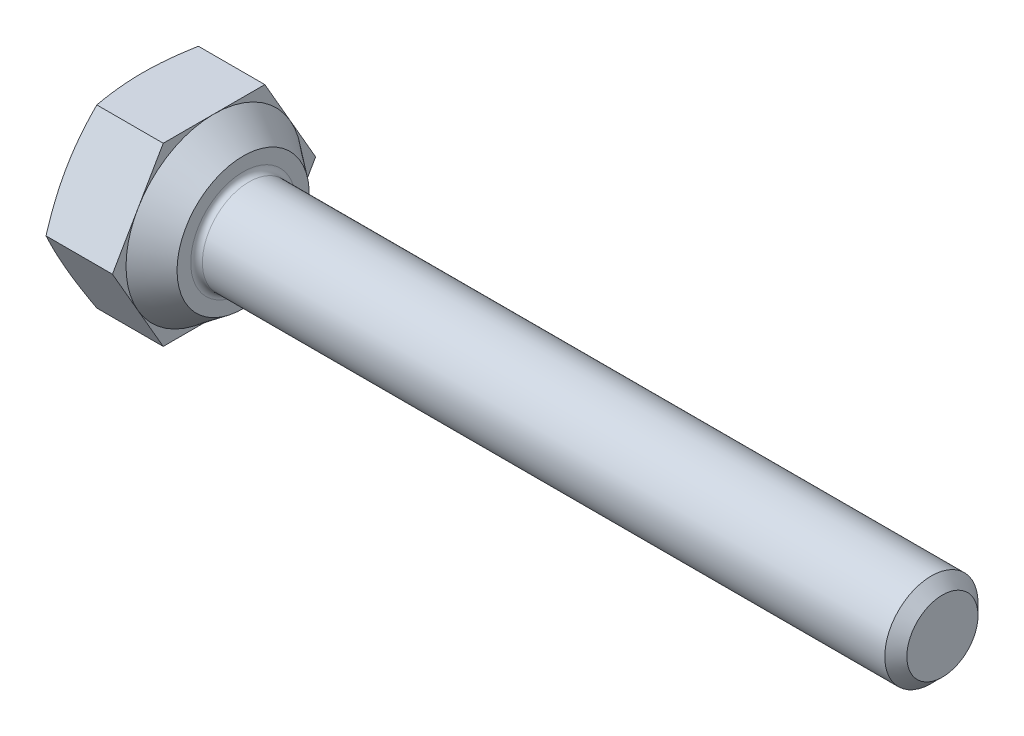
ISO-10303-21;
HEADER;
FILE_DESCRIPTION(('STEP AP214'),'2;1');
FILE_NAME('part.step','',(''),(''),'','','');
FILE_SCHEMA(('AUTOMOTIVE_DESIGN { 1 0 10303 214 1 1 1 1 }'));
ENDSEC;
DATA;
#1=APPLICATION_CONTEXT('core data for automotive mechanical design processes');
#2=APPLICATION_PROTOCOL_DEFINITION('international standard','automotive_design',2000,#1);
#3=PRODUCT_CONTEXT('',#1,'mechanical');
#4=PRODUCT('Part','Part','',(#3));
#5=PRODUCT_RELATED_PRODUCT_CATEGORY('part','',(#4));
#6=PRODUCT_DEFINITION_FORMATION('','',#4);
#7=PRODUCT_DEFINITION_CONTEXT('part definition',#1,'design');
#8=PRODUCT_DEFINITION('design','',#6,#7);
#9=PRODUCT_DEFINITION_SHAPE('','',#8);
#10=(LENGTH_UNIT() NAMED_UNIT(*) SI_UNIT(.MILLI.,.METRE.));
#11=(NAMED_UNIT(*) PLANE_ANGLE_UNIT() SI_UNIT($,.RADIAN.));
#12=(NAMED_UNIT(*) SI_UNIT($,.STERADIAN.) SOLID_ANGLE_UNIT());
#13=UNCERTAINTY_MEASURE_WITH_UNIT(LENGTH_MEASURE(1.E-05),#10,'distance_accuracy_value','');
#14=(GEOMETRIC_REPRESENTATION_CONTEXT(3) GLOBAL_UNCERTAINTY_ASSIGNED_CONTEXT((#13)) GLOBAL_UNIT_ASSIGNED_CONTEXT((#10,
#11,#12)) REPRESENTATION_CONTEXT('',''));
#15=CARTESIAN_POINT('',(0.,0.,0.));
#16=DIRECTION('',(0.,0.,1.));
#17=DIRECTION('',(1.,0.,0.));
#18=AXIS2_PLACEMENT_3D('',#15,#16,#17);
#19=CARTESIAN_POINT('',(1.725,0.,0.));
#20=DIRECTION('',(1.,0.,0.));
#21=DIRECTION('',(0.,0.,-1.));
#22=AXIS2_PLACEMENT_3D('',#19,#20,#21);
#23=PLANE('',#22);
#24=CARTESIAN_POINT('',(1.725,0.,0.));
#25=DIRECTION('',(1.,0.,0.));
#26=DIRECTION('',(0.,0.,-1.));
#27=AXIS2_PLACEMENT_3D('',#24,#25,#26);
#28=CIRCLE('',#27,0.9);
#29=CARTESIAN_POINT('',(1.725,0.,-0.9));
#30=VERTEX_POINT('',#29);
#31=EDGE_CURVE('E189',#30,#30,#28,.F.);
#32=ORIENTED_EDGE('',*,*,#31,.T.);
#33=EDGE_LOOP('',(#32));
#34=FACE_BOUND('',#33,.T.);
#35=CARTESIAN_POINT('',(1.725,0.,0.));
#36=DIRECTION('',(-1.,0.,0.));
#37=DIRECTION('',(0.,0.,1.));
#38=AXIS2_PLACEMENT_3D('',#35,#36,#37);
#39=CIRCLE('',#38,1.135);
#40=CARTESIAN_POINT('',(1.725,0.,1.135));
#41=VERTEX_POINT('',#40);
#42=EDGE_CURVE('E140',#41,#41,#39,.T.);
#43=ORIENTED_EDGE('',*,*,#42,.F.);
#44=EDGE_LOOP('',(#43));
#45=FACE_BOUND('',#44,.T.);
#46=ADVANCED_FACE('F34',(#34,#45),#23,.T.);
#47=CARTESIAN_POINT('',(1.225,0.,-1.74359781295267));
#48=DIRECTION('',(1.,0.,0.));
#49=DIRECTION('',(0.,0.,-1.));
#50=AXIS2_PLACEMENT_3D('',#47,#48,#49);
#51=PLANE('',#50);
#52=DIRECTION('',(0.,-0.866025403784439,0.5));
#53=VECTOR('',#52,1.);
#54=CARTESIAN_POINT('',(1.225,1.51,0.871798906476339));
#55=LINE('',#54,#53);
#56=CARTESIAN_POINT('',(1.225,1.51,0.871798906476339));
#57=VERTEX_POINT('',#56);
#58=CARTESIAN_POINT('',(1.225,0.755000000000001,1.30769835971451));
#59=VERTEX_POINT('',#58);
#60=EDGE_CURVE('E139',#57,#59,#55,.T.);
#61=ORIENTED_EDGE('',*,*,#60,.T.);
#62=CARTESIAN_POINT('',(1.225,0.,0.));
#63=DIRECTION('',(-1.,0.,0.));
#64=DIRECTION('',(0.,0.,1.));
#65=AXIS2_PLACEMENT_3D('',#62,#63,#64);
#66=CIRCLE('',#65,1.51);
#67=CARTESIAN_POINT('',(1.225,1.51,0.));
#68=VERTEX_POINT('',#67);
#69=EDGE_CURVE('E50',#59,#68,#66,.T.);
#70=ORIENTED_EDGE('',*,*,#69,.T.);
#71=DIRECTION('',(0.,0.,1.));
#72=VECTOR('',#71,1.);
#73=CARTESIAN_POINT('',(1.225,1.51,-0.871798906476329));
#74=LINE('',#73,#72);
#75=EDGE_CURVE('E136',#68,#57,#74,.T.);
#76=ORIENTED_EDGE('',*,*,#75,.T.);
#77=EDGE_LOOP('',(#61,#70,#76));
#78=FACE_BOUND('',#77,.T.);
#79=ADVANCED_FACE('F135',(#78),#51,.T.);
#80=CARTESIAN_POINT('',(1.225,1.51,-0.871798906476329));
#81=VERTEX_POINT('',#80);
#82=EDGE_CURVE('E146',#81,#68,#74,.T.);
#83=ORIENTED_EDGE('',*,*,#82,.T.);
#84=CARTESIAN_POINT('',(1.225,0.755,-1.3076983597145));
#85=VERTEX_POINT('',#84);
#86=EDGE_CURVE('E123',#68,#85,#66,.T.);
#87=ORIENTED_EDGE('',*,*,#86,.T.);
#88=DIRECTION('',(0.,0.866025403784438,0.5));
#89=VECTOR('',#88,1.);
#90=CARTESIAN_POINT('',(1.225,0.,-1.74359781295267));
#91=LINE('',#90,#89);
#92=EDGE_CURVE('E152',#85,#81,#91,.T.);
#93=ORIENTED_EDGE('',*,*,#92,.T.);
#94=EDGE_LOOP('',(#83,#87,#93));
#95=FACE_BOUND('',#94,.T.);
#96=ADVANCED_FACE('F151',(#95),#51,.T.);
#97=CARTESIAN_POINT('',(1.225,0.,-1.74359781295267));
#98=VERTEX_POINT('',#97);
#99=EDGE_CURVE('E149',#98,#85,#91,.T.);
#100=ORIENTED_EDGE('',*,*,#99,.T.);
#101=CARTESIAN_POINT('',(1.225,-0.755,-1.3076983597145));
#102=VERTEX_POINT('',#101);
#103=EDGE_CURVE('E126',#85,#102,#66,.T.);
#104=ORIENTED_EDGE('',*,*,#103,.T.);
#105=DIRECTION('',(0.,0.866025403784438,-0.5));
#106=VECTOR('',#105,1.);
#107=CARTESIAN_POINT('',(1.225,-1.51,-0.871798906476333));
#108=LINE('',#107,#106);
#109=EDGE_CURVE('E307',#102,#98,#108,.T.);
#110=ORIENTED_EDGE('',*,*,#109,.T.);
#111=EDGE_LOOP('',(#100,#104,#110));
#112=FACE_BOUND('',#111,.T.);
#113=ADVANCED_FACE('F338',(#112),#51,.T.);
#114=CARTESIAN_POINT('',(1.225,-1.51,-0.871798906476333));
#115=VERTEX_POINT('',#114);
#116=EDGE_CURVE('E305',#115,#102,#108,.T.);
#117=ORIENTED_EDGE('',*,*,#116,.T.);
#118=CARTESIAN_POINT('',(1.225,-1.51,0.));
#119=VERTEX_POINT('',#118);
#120=EDGE_CURVE('E339',#102,#119,#66,.T.);
#121=ORIENTED_EDGE('',*,*,#120,.T.);
#122=DIRECTION('',(0.,0.,-1.));
#123=VECTOR('',#122,1.);
#124=CARTESIAN_POINT('',(1.225,-1.51,0.871798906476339));
#125=LINE('',#124,#123);
#126=EDGE_CURVE('E163',#119,#115,#125,.T.);
#127=ORIENTED_EDGE('',*,*,#126,.T.);
#128=EDGE_LOOP('',(#117,#121,#127));
#129=FACE_BOUND('',#128,.T.);
#130=ADVANCED_FACE('F353',(#129),#51,.T.);
#131=CARTESIAN_POINT('',(1.225,-1.51,0.871798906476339));
#132=VERTEX_POINT('',#131);
#133=EDGE_CURVE('E164',#132,#119,#125,.T.);
#134=ORIENTED_EDGE('',*,*,#133,.T.);
#135=CARTESIAN_POINT('',(1.225,-0.755,1.3076983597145));
#136=VERTEX_POINT('',#135);
#137=EDGE_CURVE('E340',#119,#136,#66,.T.);
#138=ORIENTED_EDGE('',*,*,#137,.T.);
#139=DIRECTION('',(0.,-0.866025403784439,-0.5));
#140=VECTOR('',#139,1.);
#141=CARTESIAN_POINT('',(1.225,0.,1.74359781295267));
#142=LINE('',#141,#140);
#143=EDGE_CURVE('E159',#136,#132,#142,.T.);
#144=ORIENTED_EDGE('',*,*,#143,.T.);
#145=EDGE_LOOP('',(#134,#138,#144));
#146=FACE_BOUND('',#145,.T.);
#147=ADVANCED_FACE('F348',(#146),#51,.T.);
#148=CARTESIAN_POINT('',(1.225,0.,1.74359781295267));
#149=VERTEX_POINT('',#148);
#150=EDGE_CURVE('E160',#149,#136,#142,.T.);
#151=ORIENTED_EDGE('',*,*,#150,.T.);
#152=EDGE_CURVE('E141',#136,#59,#66,.T.);
#153=ORIENTED_EDGE('',*,*,#152,.T.);
#154=EDGE_CURVE('E154',#59,#149,#55,.T.);
#155=ORIENTED_EDGE('',*,*,#154,.T.);
#156=EDGE_LOOP('',(#151,#153,#155));
#157=FACE_BOUND('',#156,.T.);
#158=ADVANCED_FACE('F214',(#157),#51,.T.);
#159=CARTESIAN_POINT('',(1.225,-1.51,-0.871798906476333));
#160=DIRECTION('',(0.,0.5,0.866025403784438));
#161=DIRECTION('',(0.,-0.866025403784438,0.5));
#162=AXIS2_PLACEMENT_3D('',#159,#160,#161);
#163=PLANE('',#162);
#164=CARTESIAN_POINT('',(0.0850646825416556,0.000199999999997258,-1.7437132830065));
#165=CARTESIAN_POINT('',(0.0719138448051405,-0.0623488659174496,-1.70760067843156));
#166=CARTESIAN_POINT('',(0.0599507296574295,-0.125104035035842,-1.67136896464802));
#167=CARTESIAN_POINT('',(0.0389032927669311,-0.251022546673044,-1.59866987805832));
#168=CARTESIAN_POINT('',(0.0298212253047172,-0.314186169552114,-1.5622023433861));
#169=CARTESIAN_POINT('',(0.0151311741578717,-0.440220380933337,-1.48943645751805));
#170=CARTESIAN_POINT('',(0.00949113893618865,-0.503088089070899,-1.45313976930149));
#171=CARTESIAN_POINT('',(0.00192624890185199,-0.62897057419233,-1.38046148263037));
#172=CARTESIAN_POINT('',(0.,-0.691985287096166,-1.34407992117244));
#173=CARTESIAN_POINT('',(0.,-0.818014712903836,-1.27131679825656));
#174=CARTESIAN_POINT('',(0.00192624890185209,-0.881029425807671,-1.23493523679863));
#175=CARTESIAN_POINT('',(0.00949113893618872,-1.0069119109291,-1.16225695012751));
#176=CARTESIAN_POINT('',(0.0151311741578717,-1.06977961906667,-1.12596026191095));
#177=CARTESIAN_POINT('',(0.0298212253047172,-1.19581383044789,-1.0531943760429));
#178=CARTESIAN_POINT('',(0.0389032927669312,-1.25897745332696,-1.01672684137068));
#179=CARTESIAN_POINT('',(0.0599507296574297,-1.38489596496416,-0.944027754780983));
#180=CARTESIAN_POINT('',(0.0719138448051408,-1.44765113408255,-0.907796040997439));
#181=CARTESIAN_POINT('',(0.0850646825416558,-1.5102,-0.871683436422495));
#182=B_SPLINE_CURVE_WITH_KNOTS('',3,(#164,#165,#166,#167,#168,#169,#170,#171,#172,#173,#174,
#175,#176,#177,#178,#179,#180,#181),.UNSPECIFIED.,.F.,.F.,(4,2,2,2,2,2,2,2,4),(0.,
0.220260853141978,0.440693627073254,0.65904114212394,0.877306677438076,1.09557221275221,
1.3139197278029,1.53435250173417,1.75461335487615),.UNSPECIFIED.);
#183=CARTESIAN_POINT('',(0.0850226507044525,0.,-1.74359781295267));
#184=VERTEX_POINT('',#183);
#185=CARTESIAN_POINT('',(0.,-0.755000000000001,-1.3076983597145));
#186=VERTEX_POINT('',#185);
#187=EDGE_CURVE('E322',#184,#186,#182,.T.);
#188=ORIENTED_EDGE('',*,*,#187,.F.);
#189=DIRECTION('',(-1.,0.,0.));
#190=VECTOR('',#189,1.);
#191=CARTESIAN_POINT('',(1.225,0.,-1.74359781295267));
#192=LINE('',#191,#190);
#193=EDGE_CURVE('E179',#98,#184,#192,.T.);
#194=ORIENTED_EDGE('',*,*,#193,.F.);
#195=ORIENTED_EDGE('',*,*,#109,.F.);
#196=ORIENTED_EDGE('',*,*,#116,.F.);
#197=DIRECTION('',(-1.,0.,0.));
#198=VECTOR('',#197,1.);
#199=CARTESIAN_POINT('',(1.225,-1.51,-0.871798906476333));
#200=LINE('',#199,#198);
#201=CARTESIAN_POINT('',(0.0850226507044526,-1.51,-0.871798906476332));
#202=VERTEX_POINT('',#201);
#203=EDGE_CURVE('E167',#115,#202,#200,.T.);
#204=ORIENTED_EDGE('',*,*,#203,.T.);
#205=EDGE_CURVE('E247',#186,#202,#182,.T.);
#206=ORIENTED_EDGE('',*,*,#205,.F.);
#207=EDGE_LOOP('',(#188,#194,#195,#196,#204,#206));
#208=FACE_BOUND('',#207,.T.);
#209=ADVANCED_FACE('F36',(#208),#163,.F.);
#210=CARTESIAN_POINT('',(1.225,0.,-1.74359781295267));
#211=DIRECTION('',(0.,-0.5,0.866025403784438));
#212=DIRECTION('',(0.,-0.866025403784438,-0.5));
#213=AXIS2_PLACEMENT_3D('',#210,#211,#212);
#214=PLANE('',#213);
#215=CARTESIAN_POINT('',(0.0850646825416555,1.5102,-0.871683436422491));
#216=CARTESIAN_POINT('',(0.0719138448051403,1.44765113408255,-0.907796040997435));
#217=CARTESIAN_POINT('',(0.0599507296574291,1.38489596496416,-0.944027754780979));
#218=CARTESIAN_POINT('',(0.0389032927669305,1.25897745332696,-1.01672684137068));
#219=CARTESIAN_POINT('',(0.0298212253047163,1.19581383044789,-1.0531943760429));
#220=CARTESIAN_POINT('',(0.0151311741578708,1.06977961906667,-1.12596026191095));
#221=CARTESIAN_POINT('',(0.00949113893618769,1.0069119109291,-1.16225695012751));
#222=CARTESIAN_POINT('',(0.00192624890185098,0.88102942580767,-1.23493523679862));
#223=CARTESIAN_POINT('',(0.,0.818014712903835,-1.27131679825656));
#224=CARTESIAN_POINT('',(0.,0.691985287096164,-1.34407992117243));
#225=CARTESIAN_POINT('',(0.00192624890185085,0.628970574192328,-1.38046148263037));
#226=CARTESIAN_POINT('',(0.00949113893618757,0.503088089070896,-1.45313976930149));
#227=CARTESIAN_POINT('',(0.0151311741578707,0.440220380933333,-1.48943645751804));
#228=CARTESIAN_POINT('',(0.0298212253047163,0.314186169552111,-1.5622023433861));
#229=CARTESIAN_POINT('',(0.0389032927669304,0.25102254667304,-1.59866987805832));
#230=CARTESIAN_POINT('',(0.059950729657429,0.125104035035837,-1.67136896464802));
#231=CARTESIAN_POINT('',(0.0719138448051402,0.0623488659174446,-1.70760067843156));
#232=CARTESIAN_POINT('',(0.0850646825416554,-0.000200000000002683,-1.7437132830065));
#233=B_SPLINE_CURVE_WITH_KNOTS('',3,(#215,#216,#217,#218,#219,#220,#221,#222,#223,#224,#225,
#226,#227,#228,#229,#230,#231,#232),.UNSPECIFIED.,.F.,.F.,(4,2,2,2,2,2,2,2,4),(0.,
0.220260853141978,0.440693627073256,0.659041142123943,0.87730667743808,1.09557221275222,
1.3139197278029,1.53435250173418,1.75461335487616),.UNSPECIFIED.);
#234=CARTESIAN_POINT('',(0.0850226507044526,1.51,-0.871798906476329));
#235=VERTEX_POINT('',#234);
#236=CARTESIAN_POINT('',(0.,0.755000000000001,-1.3076983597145));
#237=VERTEX_POINT('',#236);
#238=EDGE_CURVE('E262',#235,#237,#233,.T.);
#239=ORIENTED_EDGE('',*,*,#238,.F.);
#240=DIRECTION('',(-1.,0.,0.));
#241=VECTOR('',#240,1.);
#242=CARTESIAN_POINT('',(1.225,1.51,-0.871798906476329));
#243=LINE('',#242,#241);
#244=EDGE_CURVE('E177',#81,#235,#243,.T.);
#245=ORIENTED_EDGE('',*,*,#244,.F.);
#246=ORIENTED_EDGE('',*,*,#92,.F.);
#247=ORIENTED_EDGE('',*,*,#99,.F.);
#248=ORIENTED_EDGE('',*,*,#193,.T.);
#249=EDGE_CURVE('E258',#237,#184,#233,.T.);
#250=ORIENTED_EDGE('',*,*,#249,.F.);
#251=EDGE_LOOP('',(#239,#245,#246,#247,#248,#250));
#252=FACE_BOUND('',#251,.T.);
#253=ADVANCED_FACE('F268',(#252),#214,.F.);
#254=CARTESIAN_POINT('',(1.225,1.51,-0.871798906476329));
#255=DIRECTION('',(0.,-1.,0.));
#256=DIRECTION('',(0.,0.,-1.));
#257=AXIS2_PLACEMENT_3D('',#254,#255,#256);
#258=PLANE('',#257);
#259=CARTESIAN_POINT('',(0.45432732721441,1.51,-2.30821695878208));
#260=CARTESIAN_POINT('',(0.433524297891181,1.51,-2.23989902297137));
#261=CARTESIAN_POINT('',(0.412964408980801,1.51,-2.17150590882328));
#262=CARTESIAN_POINT('',(0.372464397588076,1.51,-2.03453077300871));
#263=CARTESIAN_POINT('',(0.352524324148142,1.51,-1.96594873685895));
#264=CARTESIAN_POINT('',(0.313364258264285,1.51,-1.8284398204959));
#265=CARTESIAN_POINT('',(0.294145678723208,1.51,-1.75951253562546));
#266=CARTESIAN_POINT('',(0.256657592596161,1.51,-1.62140245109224));
#267=CARTESIAN_POINT('',(0.238388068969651,1.51,-1.55221965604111));
#268=CARTESIAN_POINT('',(0.18576941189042,1.51,-1.34592879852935));
#269=CARTESIAN_POINT('',(0.153114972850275,1.51,-1.20837710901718));
#270=CARTESIAN_POINT('',(0.0949108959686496,1.51,-0.931786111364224));
#271=CARTESIAN_POINT('',(0.0693582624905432,1.51,-0.792747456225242));
#272=CARTESIAN_POINT('',(0.0312525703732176,1.51,-0.528716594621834));
#273=CARTESIAN_POINT('',(0.0175626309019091,1.51,-0.4038987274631));
#274=CARTESIAN_POINT('',(0.00514851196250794,1.51,-0.216185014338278));
#275=CARTESIAN_POINT('',(0.00236359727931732,1.51,-0.153549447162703));
#276=CARTESIAN_POINT('',(-0.000374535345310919,1.51,-0.0282137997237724));
#277=CARTESIAN_POINT('',(-0.000327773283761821,1.51,0.0344862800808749));
#278=CARTESIAN_POINT('',(0.00260786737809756,1.51,0.160133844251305));
#279=CARTESIAN_POINT('',(0.00551102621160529,1.51,0.223080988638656));
#280=CARTESIAN_POINT('',(0.0140229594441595,1.51,0.34879509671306));
#281=CARTESIAN_POINT('',(0.0196320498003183,1.51,0.41156203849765));
#282=CARTESIAN_POINT('',(0.0401349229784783,1.51,0.599549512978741));
#283=CARTESIAN_POINT('',(0.0587016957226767,1.51,0.724371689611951));
#284=CARTESIAN_POINT('',(0.104131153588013,1.51,0.979260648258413));
#285=CARTESIAN_POINT('',(0.131381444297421,1.51,1.10925467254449));
#286=CARTESIAN_POINT('',(0.191125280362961,1.51,1.36805445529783));
#287=CARTESIAN_POINT('',(0.223620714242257,1.51,1.49685976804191));
#288=CARTESIAN_POINT('',(0.292107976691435,1.51,1.75370192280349));
#289=CARTESIAN_POINT('',(0.328104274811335,1.51,1.88173755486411));
#290=CARTESIAN_POINT('',(0.402412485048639,1.51,2.13710758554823));
#291=CARTESIAN_POINT('',(0.44072402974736,1.51,2.26444209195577));
#292=CARTESIAN_POINT('',(0.51851760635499,1.51,2.51721258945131));
#293=CARTESIAN_POINT('',(0.557982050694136,1.51,2.64265402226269));
#294=CARTESIAN_POINT('',(0.638031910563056,1.51,2.89318424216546));
#295=CARTESIAN_POINT('',(0.67861737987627,1.51,3.01827301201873));
#296=CARTESIAN_POINT('',(0.760449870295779,1.51,3.26770765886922));
#297=CARTESIAN_POINT('',(0.801693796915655,1.51,3.3920545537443));
#298=CARTESIAN_POINT('',(0.884800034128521,1.51,3.64053031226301));
#299=CARTESIAN_POINT('',(0.92666229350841,1.51,3.76465919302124));
#300=CARTESIAN_POINT('',(0.968740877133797,1.51,3.8887136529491));
#301=B_SPLINE_CURVE_WITH_KNOTS('',3,(#259,#260,#261,#262,#263,#264,#265,#266,#267,#268,#269,
#270,#271,#272,#273,#274,#275,#276,#277,#278,#279,#280,#281,#282,#283,#284,#285,#286,#287,#288,
#289,#290,#291,#292,#293,#294,#295,#296,#297,#298,#299,#300),.UNSPECIFIED.,.F.,.F.,(4,2,2,2,2,2,
2,2,2,2,2,2,2,2,2,2,2,2,2,2,4),(0.,0.214246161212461,0.428509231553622,0.643172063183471,
0.857831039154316,1.28183574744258,1.70566133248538,2.0819333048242,2.2699687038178,
2.45800277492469,2.64698170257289,2.83598270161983,3.21423905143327,3.61254754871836,
4.0109997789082,4.40996756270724,4.80887219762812,5.2033737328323,5.59789422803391,
5.99091776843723,6.38390893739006),.UNSPECIFIED.);
#302=CARTESIAN_POINT('',(0.0850226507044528,1.51,0.871798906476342));
#303=VERTEX_POINT('',#302);
#304=CARTESIAN_POINT('',(0.,1.51,0.));
#305=VERTEX_POINT('',#304);
#306=EDGE_CURVE('E58',#303,#305,#301,.F.);
#307=ORIENTED_EDGE('',*,*,#306,.F.);
#308=DIRECTION('',(-1.,0.,0.));
#309=VECTOR('',#308,1.);
#310=CARTESIAN_POINT('',(1.225,1.51,0.871798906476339));
#311=LINE('',#310,#309);
#312=EDGE_CURVE('E148',#57,#303,#311,.T.);
#313=ORIENTED_EDGE('',*,*,#312,.F.);
#314=ORIENTED_EDGE('',*,*,#75,.F.);
#315=ORIENTED_EDGE('',*,*,#82,.F.);
#316=ORIENTED_EDGE('',*,*,#244,.T.);
#317=EDGE_CURVE('E263',#305,#235,#301,.F.);
#318=ORIENTED_EDGE('',*,*,#317,.F.);
#319=EDGE_LOOP('',(#307,#313,#314,#315,#316,#318));
#320=FACE_BOUND('',#319,.T.);
#321=ADVANCED_FACE('F144',(#320),#258,.F.);
#322=CARTESIAN_POINT('',(1.225,1.51,0.871798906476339));
#323=DIRECTION('',(0.,-0.5,-0.866025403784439));
#324=DIRECTION('',(0.,0.866025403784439,-0.5));
#325=AXIS2_PLACEMENT_3D('',#322,#323,#324);
#326=PLANE('',#325);
#327=CARTESIAN_POINT('',(0.0850646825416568,-0.000199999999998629,1.74371328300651));
#328=CARTESIAN_POINT('',(0.0719138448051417,0.0623488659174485,1.70760067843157));
#329=CARTESIAN_POINT('',(0.0599507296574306,0.125104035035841,1.67136896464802));
#330=CARTESIAN_POINT('',(0.0389032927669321,0.251022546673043,1.59866987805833));
#331=CARTESIAN_POINT('',(0.0298212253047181,0.314186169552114,1.5622023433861));
#332=CARTESIAN_POINT('',(0.0151311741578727,0.440220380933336,1.48943645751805));
#333=CARTESIAN_POINT('',(0.00949113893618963,0.503088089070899,1.4531397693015));
#334=CARTESIAN_POINT('',(0.001926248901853,0.62897057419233,1.38046148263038));
#335=CARTESIAN_POINT('',(0.,0.691985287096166,1.34407992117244));
#336=CARTESIAN_POINT('',(0.,0.818014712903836,1.27131679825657));
#337=CARTESIAN_POINT('',(0.00192624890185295,0.881029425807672,1.23493523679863));
#338=CARTESIAN_POINT('',(0.00949113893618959,1.0069119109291,1.16225695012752));
#339=CARTESIAN_POINT('',(0.0151311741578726,1.06977961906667,1.12596026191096));
#340=CARTESIAN_POINT('',(0.0298212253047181,1.19581383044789,1.05319437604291));
#341=CARTESIAN_POINT('',(0.0389032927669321,1.25897745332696,1.01672684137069));
#342=CARTESIAN_POINT('',(0.0599507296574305,1.38489596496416,0.944027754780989));
#343=CARTESIAN_POINT('',(0.0719138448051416,1.44765113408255,0.907796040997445));
#344=CARTESIAN_POINT('',(0.0850646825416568,1.5102,0.871683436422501));
#345=B_SPLINE_CURVE_WITH_KNOTS('',3,(#327,#328,#329,#330,#331,#332,#333,#334,#335,#336,#337,
#338,#339,#340,#341,#342,#343,#344),.UNSPECIFIED.,.F.,.F.,(4,2,2,2,2,2,2,2,4),(0.,
0.220260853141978,0.440693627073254,0.659041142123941,0.877306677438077,1.09557221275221,
1.3139197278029,1.53435250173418,1.75461335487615),.UNSPECIFIED.);
#346=CARTESIAN_POINT('',(0.0850226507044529,0.,1.74359781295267));
#347=VERTEX_POINT('',#346);
#348=CARTESIAN_POINT('',(0.,0.755000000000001,1.30769835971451));
#349=VERTEX_POINT('',#348);
#350=EDGE_CURVE('E252',#347,#349,#345,.T.);
#351=ORIENTED_EDGE('',*,*,#350,.F.);
#352=DIRECTION('',(-1.,0.,0.));
#353=VECTOR('',#352,1.);
#354=CARTESIAN_POINT('',(1.225,0.,1.74359781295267));
#355=LINE('',#354,#353);
#356=EDGE_CURVE('E173',#149,#347,#355,.T.);
#357=ORIENTED_EDGE('',*,*,#356,.F.);
#358=ORIENTED_EDGE('',*,*,#154,.F.);
#359=ORIENTED_EDGE('',*,*,#60,.F.);
#360=ORIENTED_EDGE('',*,*,#312,.T.);
#361=EDGE_CURVE('E313',#349,#303,#345,.T.);
#362=ORIENTED_EDGE('',*,*,#361,.F.);
#363=EDGE_LOOP('',(#351,#357,#358,#359,#360,#362));
#364=FACE_BOUND('',#363,.T.);
#365=ADVANCED_FACE('F274',(#364),#326,.F.);
#366=CARTESIAN_POINT('',(1.225,0.,1.74359781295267));
#367=DIRECTION('',(0.,0.5,-0.866025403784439));
#368=DIRECTION('',(0.,0.866025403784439,0.5));
#369=AXIS2_PLACEMENT_3D('',#366,#367,#368);
#370=PLANE('',#369);
#371=CARTESIAN_POINT('',(0.085064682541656,-1.5102,0.8716834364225));
#372=CARTESIAN_POINT('',(0.0719138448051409,-1.44765113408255,0.907796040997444));
#373=CARTESIAN_POINT('',(0.0599507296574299,-1.38489596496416,0.944027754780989));
#374=CARTESIAN_POINT('',(0.0389032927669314,-1.25897745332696,1.01672684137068));
#375=CARTESIAN_POINT('',(0.0298212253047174,-1.19581383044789,1.05319437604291));
#376=CARTESIAN_POINT('',(0.015131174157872,-1.06977961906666,1.12596026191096));
#377=CARTESIAN_POINT('',(0.00949113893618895,-1.0069119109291,1.16225695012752));
#378=CARTESIAN_POINT('',(0.00192624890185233,-0.881029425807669,1.23493523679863));
#379=CARTESIAN_POINT('',(0.,-0.818014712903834,1.27131679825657));
#380=CARTESIAN_POINT('',(0.,-0.691985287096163,1.34407992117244));
#381=CARTESIAN_POINT('',(0.00192624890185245,-0.628970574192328,1.38046148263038));
#382=CARTESIAN_POINT('',(0.00949113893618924,-0.503088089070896,1.4531397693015));
#383=CARTESIAN_POINT('',(0.0151311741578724,-0.440220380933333,1.48943645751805));
#384=CARTESIAN_POINT('',(0.029821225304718,-0.314186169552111,1.5622023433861));
#385=CARTESIAN_POINT('',(0.038903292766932,-0.25102254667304,1.59866987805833));
#386=CARTESIAN_POINT('',(0.0599507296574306,-0.125104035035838,1.67136896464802));
#387=CARTESIAN_POINT('',(0.0719138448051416,-0.0623488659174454,1.70760067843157));
#388=CARTESIAN_POINT('',(0.0850646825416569,0.000200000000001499,1.74371328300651));
#389=B_SPLINE_CURVE_WITH_KNOTS('',3,(#371,#372,#373,#374,#375,#376,#377,#378,#379,#380,#381,
#382,#383,#384,#385,#386,#387,#388),.UNSPECIFIED.,.F.,.F.,(4,2,2,2,2,2,2,2,4),(0.,
0.220260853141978,0.440693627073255,0.659041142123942,0.877306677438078,1.09557221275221,
1.3139197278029,1.53435250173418,1.75461335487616),.UNSPECIFIED.);
#390=CARTESIAN_POINT('',(0.0850226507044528,-1.51,0.871798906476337));
#391=VERTEX_POINT('',#390);
#392=CARTESIAN_POINT('',(0.,-0.755000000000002,1.30769835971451));
#393=VERTEX_POINT('',#392);
#394=EDGE_CURVE('E240',#391,#393,#389,.T.);
#395=ORIENTED_EDGE('',*,*,#394,.F.);
#396=DIRECTION('',(-1.,0.,0.));
#397=VECTOR('',#396,1.);
#398=CARTESIAN_POINT('',(1.225,-1.51,0.871798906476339));
#399=LINE('',#398,#397);
#400=EDGE_CURVE('E170',#132,#391,#399,.T.);
#401=ORIENTED_EDGE('',*,*,#400,.F.);
#402=ORIENTED_EDGE('',*,*,#143,.F.);
#403=ORIENTED_EDGE('',*,*,#150,.F.);
#404=ORIENTED_EDGE('',*,*,#356,.T.);
#405=EDGE_CURVE('E318',#393,#347,#389,.T.);
#406=ORIENTED_EDGE('',*,*,#405,.F.);
#407=EDGE_LOOP('',(#395,#401,#402,#403,#404,#406));
#408=FACE_BOUND('',#407,.T.);
#409=ADVANCED_FACE('F277',(#408),#370,.F.);
#410=CARTESIAN_POINT('',(1.225,-1.51,0.871798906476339));
#411=DIRECTION('',(0.,1.,0.));
#412=DIRECTION('',(0.,0.,1.));
#413=AXIS2_PLACEMENT_3D('',#410,#411,#412);
#414=PLANE('',#413);
#415=CARTESIAN_POINT('',(0.454327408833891,-1.51,-2.30821722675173));
#416=CARTESIAN_POINT('',(0.433524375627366,-1.51,-2.23989928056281));
#417=CARTESIAN_POINT('',(0.41296448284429,-1.51,-2.17150615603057));
#418=CARTESIAN_POINT('',(0.372464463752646,-1.51,-2.03453099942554));
#419=CARTESIAN_POINT('',(0.352524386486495,-1.51,-1.96594895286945));
#420=CARTESIAN_POINT('',(0.313364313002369,-1.51,-1.82844001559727));
#421=CARTESIAN_POINT('',(0.294145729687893,-1.51,-1.75951272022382));
#422=CARTESIAN_POINT('',(0.256657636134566,-1.51,-1.62140261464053));
#423=CARTESIAN_POINT('',(0.238388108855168,-1.51,-1.55221980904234));
#424=CARTESIAN_POINT('',(0.185769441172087,-1.51,-1.34592892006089));
#425=CARTESIAN_POINT('',(0.153114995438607,-1.51,-1.20837720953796));
#426=CARTESIAN_POINT('',(0.0949109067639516,-1.51,-0.931786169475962));
#427=CARTESIAN_POINT('',(0.0693582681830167,-1.51,-0.792747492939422));
#428=CARTESIAN_POINT('',(0.031252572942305,-1.51,-0.528716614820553));
#429=CARTESIAN_POINT('',(0.0175626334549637,-1.51,-0.40389875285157));
#430=CARTESIAN_POINT('',(0.00514851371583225,-1.51,-0.216185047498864));
#431=CARTESIAN_POINT('',(0.00236359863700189,-1.51,-0.153549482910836));
#432=CARTESIAN_POINT('',(-0.000374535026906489,-1.51,-0.0282138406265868));
#433=CARTESIAN_POINT('',(-0.000327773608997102,-1.51,0.0344862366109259));
#434=CARTESIAN_POINT('',(0.00260786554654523,-1.51,0.160133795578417));
#435=CARTESIAN_POINT('',(0.00551102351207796,-1.51,0.223080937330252));
#436=CARTESIAN_POINT('',(0.0140229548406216,-1.51,0.348795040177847));
#437=CARTESIAN_POINT('',(0.0196320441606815,-1.51,0.411561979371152));
#438=CARTESIAN_POINT('',(0.0401349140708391,-1.51,0.599549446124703));
#439=CARTESIAN_POINT('',(0.0587016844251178,-1.51,0.724371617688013));
#440=CARTESIAN_POINT('',(0.104131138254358,-1.51,0.979260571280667));
#441=CARTESIAN_POINT('',(0.13138142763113,-1.51,1.10925459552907));
#442=CARTESIAN_POINT('',(0.191125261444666,-1.51,1.36805437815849));
#443=CARTESIAN_POINT('',(0.223620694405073,-1.51,1.49685969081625));
#444=CARTESIAN_POINT('',(0.292107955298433,-1.51,1.75370184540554));
#445=CARTESIAN_POINT('',(0.328104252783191,-1.51,1.88173747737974));
#446=CARTESIAN_POINT('',(0.402412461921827,-1.51,2.13710750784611));
#447=CARTESIAN_POINT('',(0.440724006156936,-1.51,2.26444201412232));
#448=CARTESIAN_POINT('',(0.518517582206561,-1.51,2.51721251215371));
#449=CARTESIAN_POINT('',(0.557982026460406,-1.51,2.64265394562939));
#450=CARTESIAN_POINT('',(0.63803188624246,-1.51,2.89318416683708));
#451=CARTESIAN_POINT('',(0.67861735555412,-1.51,3.01827293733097));
#452=CARTESIAN_POINT('',(0.760449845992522,-1.51,3.26770758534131));
#453=CARTESIAN_POINT('',(0.801693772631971,-1.51,3.39205448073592));
#454=CARTESIAN_POINT('',(0.884800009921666,-1.51,3.64053024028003));
#455=CARTESIAN_POINT('',(0.9266622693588,-1.51,3.76465912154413));
#456=CARTESIAN_POINT('',(0.968740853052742,-1.51,3.88871358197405));
#457=B_SPLINE_CURVE_WITH_KNOTS('',3,(#415,#416,#417,#418,#419,#420,#421,#422,#423,#424,#425,
#426,#427,#428,#429,#430,#431,#432,#433,#434,#435,#436,#437,#438,#439,#440,#441,#442,#443,#444,
#445,#446,#447,#448,#449,#450,#451,#452,#453,#454,#455,#456),.UNSPECIFIED.,.F.,.F.,(4,2,2,2,2,2,
2,2,2,2,2,2,2,2,2,2,2,2,2,2,4),(0.,0.214246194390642,0.428509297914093,0.643172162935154,
0.857831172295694,1.28183594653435,1.70566159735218,2.08193355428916,2.26996894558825,
2.45800300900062,2.64698192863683,2.83598291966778,3.2142392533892,3.61254774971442,
4.01099997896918,4.40996776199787,4.80887239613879,5.20337393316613,5.59789443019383,
5.99091797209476,6.38390914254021),.UNSPECIFIED.);
#458=CARTESIAN_POINT('',(0.,-1.51,0.));
#459=VERTEX_POINT('',#458);
#460=EDGE_CURVE('E296',#202,#459,#457,.T.);
#461=ORIENTED_EDGE('',*,*,#460,.F.);
#462=ORIENTED_EDGE('',*,*,#203,.F.);
#463=ORIENTED_EDGE('',*,*,#126,.F.);
#464=ORIENTED_EDGE('',*,*,#133,.F.);
#465=ORIENTED_EDGE('',*,*,#400,.T.);
#466=EDGE_CURVE('E230',#459,#391,#457,.T.);
#467=ORIENTED_EDGE('',*,*,#466,.F.);
#468=EDGE_LOOP('',(#461,#462,#463,#464,#465,#467));
#469=FACE_BOUND('',#468,.T.);
#470=ADVANCED_FACE('F281',(#469),#414,.F.);
#471=CARTESIAN_POINT('',(0.,0.,0.));
#472=DIRECTION('',(1.,0.,0.));
#473=DIRECTION('',(0.,0.,-1.));
#474=AXIS2_PLACEMENT_3D('',#471,#472,#473);
#475=CONICAL_SURFACE('',#474,1.51,1.22173047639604);
#476=ORIENTED_EDGE('',*,*,#249,.T.);
#477=ORIENTED_EDGE('',*,*,#187,.T.);
#478=CARTESIAN_POINT('',(0.,0.,0.));
#479=DIRECTION('',(1.,0.,0.));
#480=DIRECTION('',(0.,0.,-1.));
#481=AXIS2_PLACEMENT_3D('',#478,#479,#480);
#482=CIRCLE('',#481,1.51);
#483=EDGE_CURVE('E182',#186,#237,#482,.T.);
#484=ORIENTED_EDGE('',*,*,#483,.T.);
#485=EDGE_LOOP('',(#476,#477,#484));
#486=FACE_BOUND('',#485,.T.);
#487=ADVANCED_FACE('F285',(#486),#475,.T.);
#488=ORIENTED_EDGE('',*,*,#205,.T.);
#489=ORIENTED_EDGE('',*,*,#460,.T.);
#490=EDGE_CURVE('E185',#459,#186,#482,.T.);
#491=ORIENTED_EDGE('',*,*,#490,.T.);
#492=EDGE_LOOP('',(#488,#489,#491));
#493=FACE_BOUND('',#492,.T.);
#494=ADVANCED_FACE('F290',(#493),#475,.T.);
#495=ORIENTED_EDGE('',*,*,#394,.T.);
#496=EDGE_CURVE('E331',#393,#459,#482,.T.);
#497=ORIENTED_EDGE('',*,*,#496,.T.);
#498=ORIENTED_EDGE('',*,*,#466,.T.);
#499=EDGE_LOOP('',(#495,#497,#498));
#500=FACE_BOUND('',#499,.T.);
#501=ADVANCED_FACE('F225',(#500),#475,.T.);
#502=ORIENTED_EDGE('',*,*,#350,.T.);
#503=EDGE_CURVE('E337',#349,#393,#482,.T.);
#504=ORIENTED_EDGE('',*,*,#503,.T.);
#505=ORIENTED_EDGE('',*,*,#405,.T.);
#506=EDGE_LOOP('',(#502,#504,#505));
#507=FACE_BOUND('',#506,.T.);
#508=ADVANCED_FACE('F224',(#507),#475,.T.);
#509=ORIENTED_EDGE('',*,*,#306,.T.);
#510=CARTESIAN_POINT('',(0.,0.,0.));
#511=DIRECTION('',(-1.,0.,0.));
#512=DIRECTION('',(0.,0.,1.));
#513=AXIS2_PLACEMENT_3D('',#510,#511,#512);
#514=CIRCLE('',#513,1.51);
#515=EDGE_CURVE('E336',#349,#305,#514,.T.);
#516=ORIENTED_EDGE('',*,*,#515,.F.);
#517=ORIENTED_EDGE('',*,*,#361,.T.);
#518=EDGE_LOOP('',(#509,#516,#517));
#519=FACE_BOUND('',#518,.T.);
#520=ADVANCED_FACE('F219',(#519),#475,.T.);
#521=ORIENTED_EDGE('',*,*,#317,.T.);
#522=ORIENTED_EDGE('',*,*,#238,.T.);
#523=EDGE_CURVE('E186',#237,#305,#482,.T.);
#524=ORIENTED_EDGE('',*,*,#523,.T.);
#525=EDGE_LOOP('',(#521,#522,#524));
#526=FACE_BOUND('',#525,.T.);
#527=ADVANCED_FACE('F223',(#526),#475,.T.);
#528=CARTESIAN_POINT('',(0.,0.,-1.74359781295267));
#529=DIRECTION('',(1.,0.,0.));
#530=DIRECTION('',(0.,0.,-1.));
#531=AXIS2_PLACEMENT_3D('',#528,#529,#530);
#532=PLANE('',#531);
#533=ORIENTED_EDGE('',*,*,#523,.F.);
#534=ORIENTED_EDGE('',*,*,#483,.F.);
#535=ORIENTED_EDGE('',*,*,#490,.F.);
#536=ORIENTED_EDGE('',*,*,#496,.F.);
#537=ORIENTED_EDGE('',*,*,#503,.F.);
#538=ORIENTED_EDGE('',*,*,#515,.T.);
#539=EDGE_LOOP('',(#533,#534,#535,#536,#537,#538));
#540=FACE_BOUND('',#539,.T.);
#541=ADVANCED_FACE('F226',(#540),#532,.F.);
#542=CARTESIAN_POINT('',(1.225,0.,0.));
#543=DIRECTION('',(-1.,0.,0.));
#544=DIRECTION('',(0.,0.,1.));
#545=AXIS2_PLACEMENT_3D('',#542,#543,#544);
#546=CONICAL_SURFACE('',#545,1.51,0.643501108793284);
#547=ORIENTED_EDGE('',*,*,#42,.T.);
#548=EDGE_LOOP('',(#547));
#549=FACE_BOUND('',#548,.T.);
#550=ORIENTED_EDGE('',*,*,#69,.F.);
#551=ORIENTED_EDGE('',*,*,#152,.F.);
#552=ORIENTED_EDGE('',*,*,#137,.F.);
#553=ORIENTED_EDGE('',*,*,#120,.F.);
#554=ORIENTED_EDGE('',*,*,#103,.F.);
#555=ORIENTED_EDGE('',*,*,#86,.F.);
#556=EDGE_LOOP('',(#550,#551,#552,#553,#554,#555));
#557=FACE_BOUND('',#556,.T.);
#558=ADVANCED_FACE('F124',(#549,#557),#546,.T.);
#559=CARTESIAN_POINT('',(13.725,0.,0.));
#560=DIRECTION('',(-1.,0.,0.));
#561=DIRECTION('',(0.,0.,1.));
#562=AXIS2_PLACEMENT_3D('',#559,#560,#561);
#563=CYLINDRICAL_SURFACE('',#562,0.8);
#564=CARTESIAN_POINT('',(13.5355,0.,0.));
#565=DIRECTION('',(1.,0.,0.));
#566=DIRECTION('',(0.,0.,-1.));
#567=AXIS2_PLACEMENT_3D('',#564,#565,#566);
#568=CIRCLE('',#567,0.8);
#569=CARTESIAN_POINT('',(13.5355,0.,-0.800000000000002));
#570=VERTEX_POINT('',#569);
#571=EDGE_CURVE('E12',#570,#570,#568,.F.);
#572=ORIENTED_EDGE('',*,*,#571,.T.);
#573=EDGE_LOOP('',(#572));
#574=FACE_BOUND('',#573,.T.);
#575=CARTESIAN_POINT('',(1.825,0.,0.));
#576=DIRECTION('',(1.,0.,0.));
#577=DIRECTION('',(0.,0.,-1.));
#578=AXIS2_PLACEMENT_3D('',#575,#576,#577);
#579=CIRCLE('',#578,0.8);
#580=CARTESIAN_POINT('',(1.825,0.,-0.8));
#581=VERTEX_POINT('',#580);
#582=EDGE_CURVE('E130',#581,#581,#579,.T.);
#583=ORIENTED_EDGE('',*,*,#582,.T.);
#584=EDGE_LOOP('',(#583));
#585=FACE_BOUND('',#584,.T.);
#586=ADVANCED_FACE('F455',(#574,#585),#563,.T.);
#587=CARTESIAN_POINT('',(13.725,0.,0.));
#588=DIRECTION('',(1.,0.,0.));
#589=DIRECTION('',(0.,0.,-1.));
#590=AXIS2_PLACEMENT_3D('',#587,#588,#589);
#591=PLANE('',#590);
#592=CARTESIAN_POINT('',(13.725,0.,0.));
#593=DIRECTION('',(1.,0.,0.));
#594=DIRECTION('',(0.,0.,-1.));
#595=AXIS2_PLACEMENT_3D('',#592,#593,#594);
#596=CIRCLE('',#595,0.610500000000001);
#597=CARTESIAN_POINT('',(13.725,0.,-0.610500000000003));
#598=VERTEX_POINT('',#597);
#599=EDGE_CURVE('E43',#598,#598,#596,.T.);
#600=ORIENTED_EDGE('',*,*,#599,.T.);
#601=EDGE_LOOP('',(#600));
#602=FACE_BOUND('',#601,.T.);
#603=ADVANCED_FACE('F194',(#602),#591,.T.);
#604=CARTESIAN_POINT('',(1.825,0.,0.));
#605=DIRECTION('',(1.,0.,0.));
#606=DIRECTION('',(0.,0.,-1.));
#607=AXIS2_PLACEMENT_3D('',#604,#605,#606);
#608=TOROIDAL_SURFACE('',#607,0.9,0.1);
#609=ORIENTED_EDGE('',*,*,#31,.F.);
#610=EDGE_LOOP('',(#609));
#611=FACE_BOUND('',#610,.T.);
#612=ORIENTED_EDGE('',*,*,#582,.F.);
#613=EDGE_LOOP('',(#612));
#614=FACE_BOUND('',#613,.T.);
#615=ADVANCED_FACE('F198',(#611,#614),#608,.F.);
#616=CARTESIAN_POINT('',(13.725,0.,0.));
#617=DIRECTION('',(-1.,0.,0.));
#618=DIRECTION('',(0.,0.,1.));
#619=AXIS2_PLACEMENT_3D('',#616,#617,#618);
#620=CONICAL_SURFACE('',#619,0.610500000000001,0.785398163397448);
#621=ORIENTED_EDGE('',*,*,#571,.F.);
#622=EDGE_LOOP('',(#621));
#623=FACE_BOUND('',#622,.T.);
#624=ORIENTED_EDGE('',*,*,#599,.F.);
#625=EDGE_LOOP('',(#624));
#626=FACE_BOUND('',#625,.T.);
#627=ADVANCED_FACE('F196',(#623,#626),#620,.T.);
#628=CLOSED_SHELL('',(#46,#79,#96,#113,#130,#147,#158,#209,#253,#321,#365,#409,#470,#487,#494,
#501,#508,#520,#527,#541,#558,#586,#603,#615,#627));
#629=MANIFOLD_SOLID_BREP('B2',#628);
#630=ADVANCED_BREP_SHAPE_REPRESENTATION('',(#18,#629),#14);
#631=SHAPE_DEFINITION_REPRESENTATION(#9,#630);
ENDSEC;
END-ISO-10303-21;
